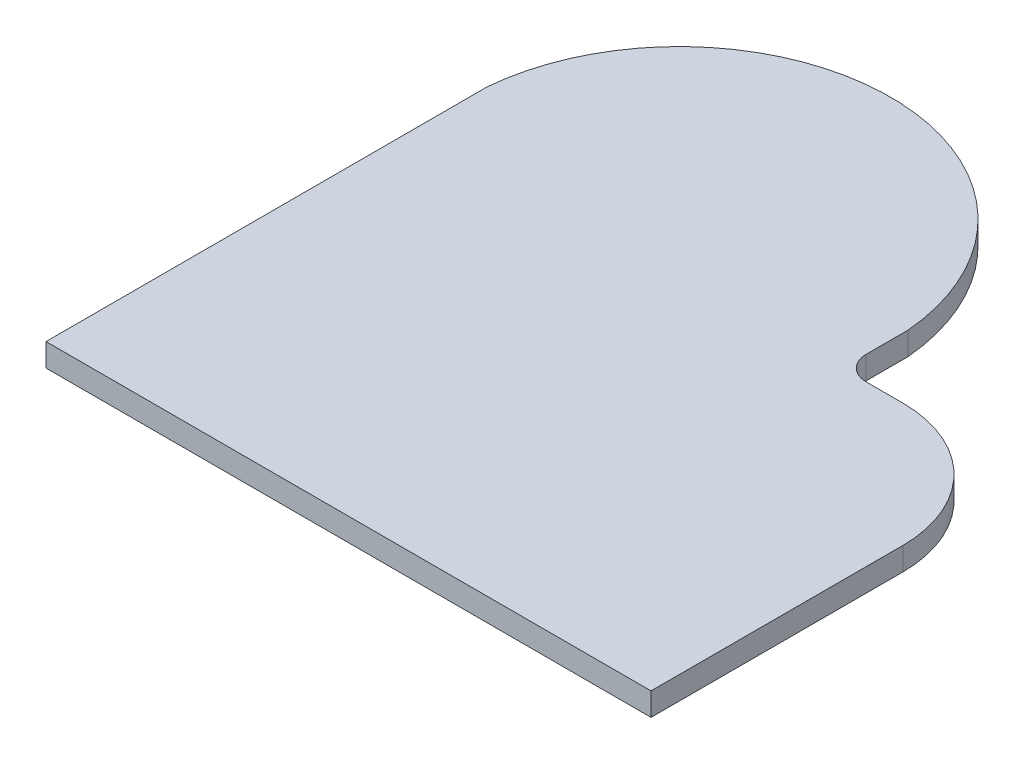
from build123d import *

# Parameters (mm, degrees)
SKETCH2_W = 83.566
SKETCH2_H = 6.35
LID_DEPTH = 3.175


with BuildPart() as part:
    # Sketch2 → lid (new body)
    with BuildSketch(Plane(origin=(0, 0, 0), x_dir=(1, 0, 0), z_dir=(0, 1, 0))):
        with Locations((-34.925, -41.783)):
            Rectangle(SKETCH2_W, SKETCH2_H)
        with BuildLine():
            Line((-76.708, 0), (-76.708, 15.953751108))
            ThreePointArc((-76.708, 15.953751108), (-47.625, 42.606368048), (-18.542, 15.953751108))
            Line((-18.542, 15.953751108), (-18.542, 10.16))
            ThreePointArc((-18.542, 10.16), (-17.574866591, 7.825133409), (-15.24, 6.858))
            Line((-15.24, 6.858), (-10.16, 6.858))
            ThreePointArc((-10.16, 6.858), (1.873543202, 1.873543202), (6.858, -10.16))
            Line((6.858, -10.16), (6.858, -38.608))
            Line((6.858, -38.608), (-76.708, -38.608))
            Line((-76.708, -38.608), (-76.708, 0))
        make_face()
    extrude(amount=LID_DEPTH)


solid = part.part
